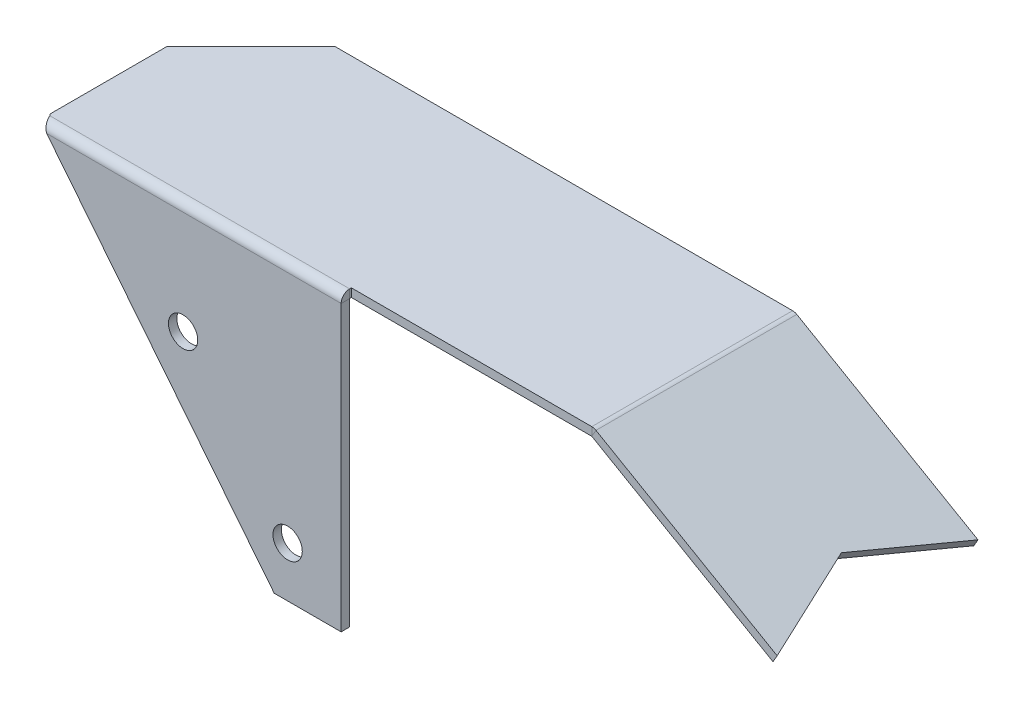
ISO-10303-21;
HEADER;
FILE_DESCRIPTION(('STEP AP214'),'2;1');
FILE_NAME('part.step','',(''),(''),'','','');
FILE_SCHEMA(('AUTOMOTIVE_DESIGN { 1 0 10303 214 1 1 1 1 }'));
ENDSEC;
DATA;
#1=APPLICATION_CONTEXT('core data for automotive mechanical design processes');
#2=APPLICATION_PROTOCOL_DEFINITION('international standard','automotive_design',2000,#1);
#3=PRODUCT_CONTEXT('',#1,'mechanical');
#4=PRODUCT('Part','Part','',(#3));
#5=PRODUCT_RELATED_PRODUCT_CATEGORY('part','',(#4));
#6=PRODUCT_DEFINITION_FORMATION('','',#4);
#7=PRODUCT_DEFINITION_CONTEXT('part definition',#1,'design');
#8=PRODUCT_DEFINITION('design','',#6,#7);
#9=PRODUCT_DEFINITION_SHAPE('','',#8);
#10=(LENGTH_UNIT() NAMED_UNIT(*) SI_UNIT(.MILLI.,.METRE.));
#11=(NAMED_UNIT(*) PLANE_ANGLE_UNIT() SI_UNIT($,.RADIAN.));
#12=(NAMED_UNIT(*) SI_UNIT($,.STERADIAN.) SOLID_ANGLE_UNIT());
#13=UNCERTAINTY_MEASURE_WITH_UNIT(LENGTH_MEASURE(1.E-05),#10,'distance_accuracy_value','');
#14=(GEOMETRIC_REPRESENTATION_CONTEXT(3) GLOBAL_UNCERTAINTY_ASSIGNED_CONTEXT((#13)) GLOBAL_UNIT_ASSIGNED_CONTEXT((#10,
#11,#12)) REPRESENTATION_CONTEXT('',''));
#15=CARTESIAN_POINT('',(0.,0.,0.));
#16=DIRECTION('',(0.,0.,1.));
#17=DIRECTION('',(1.,0.,0.));
#18=AXIS2_PLACEMENT_3D('',#15,#16,#17);
#19=CARTESIAN_POINT('',(0.,35.0000000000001,33.7811061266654));
#20=DIRECTION('',(0.,-1.,0.));
#21=DIRECTION('',(-1.,0.,0.));
#22=AXIS2_PLACEMENT_3D('',#19,#20,#21);
#23=PLANE('',#22);
#24=DIRECTION('',(1.,0.,0.));
#25=VECTOR('',#24,1.);
#26=CARTESIAN_POINT('',(8.,35.,-1.2188938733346));
#27=LINE('',#26,#25);
#28=CARTESIAN_POINT('',(8.,35.,-1.2188938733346));
#29=VERTEX_POINT('',#28);
#30=CARTESIAN_POINT('',(36.7317828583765,35.,-1.21889387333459));
#31=VERTEX_POINT('',#30);
#32=EDGE_CURVE('E67',#29,#31,#27,.T.);
#33=ORIENTED_EDGE('',*,*,#32,.T.);
#34=DIRECTION('',(0.,0.,-1.));
#35=VECTOR('',#34,1.);
#36=CARTESIAN_POINT('',(36.7317828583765,35.0000000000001,33.7811061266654));
#37=LINE('',#36,#35);
#38=CARTESIAN_POINT('',(36.7317828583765,34.9999999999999,-25.2188938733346));
#39=VERTEX_POINT('',#38);
#40=EDGE_CURVE('E59',#31,#39,#37,.T.);
#41=ORIENTED_EDGE('',*,*,#40,.T.);
#42=DIRECTION('',(-1.,0.,0.));
#43=VECTOR('',#42,1.);
#44=CARTESIAN_POINT('',(62.,35.,-25.2188938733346));
#45=LINE('',#44,#43);
#46=CARTESIAN_POINT('',(-18.,34.9999999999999,-25.2188938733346));
#47=VERTEX_POINT('',#46);
#48=EDGE_CURVE('E75',#39,#47,#45,.T.);
#49=ORIENTED_EDGE('',*,*,#48,.T.);
#50=DIRECTION('',(-0.707106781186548,0.,0.707106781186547));
#51=VECTOR('',#50,1.);
#52=CARTESIAN_POINT('',(-18.,34.9999999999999,-25.2188938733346));
#53=LINE('',#52,#51);
#54=CARTESIAN_POINT('',(-28.,35.,-15.2188938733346));
#55=VERTEX_POINT('',#54);
#56=EDGE_CURVE('E418',#47,#55,#53,.T.);
#57=ORIENTED_EDGE('',*,*,#56,.T.);
#58=DIRECTION('',(0.,0.,1.));
#59=VECTOR('',#58,1.);
#60=CARTESIAN_POINT('',(-28.,35.,-15.2188938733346));
#61=LINE('',#60,#59);
#62=CARTESIAN_POINT('',(-28.,35.,-1.2188938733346));
#63=VERTEX_POINT('',#62);
#64=EDGE_CURVE('E440',#55,#63,#61,.T.);
#65=ORIENTED_EDGE('',*,*,#64,.T.);
#66=DIRECTION('',(0.624695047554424,0.,0.78086880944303));
#67=VECTOR('',#66,1.);
#68=CARTESIAN_POINT('',(-28.,35.,-1.2188938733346));
#69=LINE('',#68,#67);
#70=CARTESIAN_POINT('',(-27.8328849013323,35.,-1.01));
#71=VERTEX_POINT('',#70);
#72=EDGE_CURVE('E316',#63,#71,#69,.T.);
#73=ORIENTED_EDGE('',*,*,#72,.T.);
#74=DIRECTION('',(-1.,0.,0.));
#75=VECTOR('',#74,1.);
#76=CARTESIAN_POINT('',(0.,35.,-1.01));
#77=LINE('',#76,#75);
#78=CARTESIAN_POINT('',(8.,35.,-1.01));
#79=VERTEX_POINT('',#78);
#80=EDGE_CURVE('E443',#79,#71,#77,.T.);
#81=ORIENTED_EDGE('',*,*,#80,.F.);
#82=DIRECTION('',(0.,0.,-1.));
#83=VECTOR('',#82,1.);
#84=CARTESIAN_POINT('',(7.99999999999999,35.0000000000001,33.7811061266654));
#85=LINE('',#84,#83);
#86=EDGE_CURVE('E419',#79,#29,#85,.T.);
#87=ORIENTED_EDGE('',*,*,#86,.T.);
#88=EDGE_LOOP('',(#33,#41,#49,#57,#65,#73,#81,#87));
#89=FACE_BOUND('',#88,.T.);
#90=ADVANCED_FACE('F50',(#89),#23,.F.);
#91=CARTESIAN_POINT('',(-28.,34.,-1.2188938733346));
#92=DIRECTION('',(-0.780868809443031,0.,0.624695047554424));
#93=DIRECTION('',(0.624695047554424,0.,0.780868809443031));
#94=AXIS2_PLACEMENT_3D('',#91,#92,#93);
#95=PLANE('',#94);
#96=DIRECTION('',(0.624695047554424,0.,0.78086880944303));
#97=VECTOR('',#96,1.);
#98=CARTESIAN_POINT('',(-28.,34.,-1.2188938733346));
#99=LINE('',#98,#97);
#100=CARTESIAN_POINT('',(-28.,34.,-1.2188938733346));
#101=VERTEX_POINT('',#100);
#102=CARTESIAN_POINT('',(-27.8328849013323,34.,-1.01));
#103=VERTEX_POINT('',#102);
#104=EDGE_CURVE('E431',#101,#103,#99,.T.);
#105=ORIENTED_EDGE('',*,*,#104,.T.);
#106=CARTESIAN_POINT('',(-27.8328849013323,35.,-1.01));
#107=CARTESIAN_POINT('',(-27.8328849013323,34.,-1.01));
#108=B_SPLINE_CURVE_WITH_KNOTS('',1,(#106,#107),.UNSPECIFIED.,.F.,.F.,(2,2),(0.,1.),.UNSPECIFIED.);
#109=EDGE_CURVE('E411',#103,#71,#108,.F.);
#110=ORIENTED_EDGE('',*,*,#109,.T.);
#111=ORIENTED_EDGE('',*,*,#72,.F.);
#112=DIRECTION('',(0.,1.,0.));
#113=VECTOR('',#112,1.);
#114=CARTESIAN_POINT('',(-28.,34.,-1.2188938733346));
#115=LINE('',#114,#113);
#116=EDGE_CURVE('E435',#101,#63,#115,.T.);
#117=ORIENTED_EDGE('',*,*,#116,.F.);
#118=EDGE_LOOP('',(#105,#110,#111,#117));
#119=FACE_BOUND('',#118,.T.);
#120=ADVANCED_FACE('F388',(#119),#95,.T.);
#121=CARTESIAN_POINT('',(7.99999999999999,34.0000000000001,33.7811061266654));
#122=DIRECTION('',(1.,0.,0.));
#123=DIRECTION('',(0.,-1.,0.));
#124=AXIS2_PLACEMENT_3D('',#121,#122,#123);
#125=PLANE('',#124);
#126=ORIENTED_EDGE('',*,*,#86,.F.);
#127=DIRECTION('',(0.,-1.,0.));
#128=VECTOR('',#127,1.);
#129=CARTESIAN_POINT('',(8.,34.0000000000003,-1.01));
#130=LINE('',#129,#128);
#131=CARTESIAN_POINT('',(8.,34.,-1.01));
#132=VERTEX_POINT('',#131);
#133=EDGE_CURVE('E428',#79,#132,#130,.T.);
#134=ORIENTED_EDGE('',*,*,#133,.T.);
#135=DIRECTION('',(0.,0.,-1.));
#136=VECTOR('',#135,1.);
#137=CARTESIAN_POINT('',(7.99999999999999,34.0000000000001,33.7811061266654));
#138=LINE('',#137,#136);
#139=CARTESIAN_POINT('',(8.,34.,-1.2188938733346));
#140=VERTEX_POINT('',#139);
#141=EDGE_CURVE('E417',#132,#140,#138,.T.);
#142=ORIENTED_EDGE('',*,*,#141,.T.);
#143=DIRECTION('',(0.,1.,0.));
#144=VECTOR('',#143,1.);
#145=CARTESIAN_POINT('',(8.,34.,-1.2188938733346));
#146=LINE('',#145,#144);
#147=EDGE_CURVE('E478',#140,#29,#146,.T.);
#148=ORIENTED_EDGE('',*,*,#147,.T.);
#149=EDGE_LOOP('',(#126,#134,#142,#148));
#150=FACE_BOUND('',#149,.T.);
#151=ADVANCED_FACE('F385',(#150),#125,.T.);
#152=CARTESIAN_POINT('',(0.,34.0000000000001,33.7811061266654));
#153=DIRECTION('',(0.,-1.,0.));
#154=DIRECTION('',(-1.,0.,0.));
#155=AXIS2_PLACEMENT_3D('',#152,#153,#154);
#156=PLANE('',#155);
#157=DIRECTION('',(0.,0.,-1.));
#158=VECTOR('',#157,1.);
#159=CARTESIAN_POINT('',(36.7317828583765,34.0000000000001,33.7811061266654));
#160=LINE('',#159,#158);
#161=CARTESIAN_POINT('',(36.7317828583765,34.,-1.21889387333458));
#162=VERTEX_POINT('',#161);
#163=CARTESIAN_POINT('',(36.7317828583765,33.9999999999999,-25.2188938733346));
#164=VERTEX_POINT('',#163);
#165=EDGE_CURVE('E402',#162,#164,#160,.T.);
#166=ORIENTED_EDGE('',*,*,#165,.F.);
#167=DIRECTION('',(1.,0.,0.));
#168=VECTOR('',#167,1.);
#169=CARTESIAN_POINT('',(8.,34.,-1.2188938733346));
#170=LINE('',#169,#168);
#171=EDGE_CURVE('E415',#140,#162,#170,.T.);
#172=ORIENTED_EDGE('',*,*,#171,.F.);
#173=ORIENTED_EDGE('',*,*,#141,.F.);
#174=DIRECTION('',(-1.,0.,0.));
#175=VECTOR('',#174,1.);
#176=CARTESIAN_POINT('',(0.,34.,-1.01));
#177=LINE('',#176,#175);
#178=EDGE_CURVE('E432',#132,#103,#177,.T.);
#179=ORIENTED_EDGE('',*,*,#178,.T.);
#180=ORIENTED_EDGE('',*,*,#104,.F.);
#181=DIRECTION('',(0.,0.,1.));
#182=VECTOR('',#181,1.);
#183=CARTESIAN_POINT('',(-28.,34.,-15.2188938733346));
#184=LINE('',#183,#182);
#185=CARTESIAN_POINT('',(-28.,34.,-15.2188938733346));
#186=VERTEX_POINT('',#185);
#187=EDGE_CURVE('E479',#186,#101,#184,.T.);
#188=ORIENTED_EDGE('',*,*,#187,.F.);
#189=DIRECTION('',(-0.707106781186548,0.,0.707106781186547));
#190=VECTOR('',#189,1.);
#191=CARTESIAN_POINT('',(-18.,33.9999999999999,-25.2188938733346));
#192=LINE('',#191,#190);
#193=CARTESIAN_POINT('',(-18.,33.9999999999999,-25.2188938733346));
#194=VERTEX_POINT('',#193);
#195=EDGE_CURVE('E480',#194,#186,#192,.T.);
#196=ORIENTED_EDGE('',*,*,#195,.F.);
#197=DIRECTION('',(-1.,0.,0.));
#198=VECTOR('',#197,1.);
#199=CARTESIAN_POINT('',(62.,34.,-25.2188938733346));
#200=LINE('',#199,#198);
#201=EDGE_CURVE('E54',#164,#194,#200,.T.);
#202=ORIENTED_EDGE('',*,*,#201,.F.);
#203=EDGE_LOOP('',(#166,#172,#173,#179,#180,#188,#196,#202));
#204=FACE_BOUND('',#203,.T.);
#205=ADVANCED_FACE('F379',(#204),#156,.T.);
#206=CARTESIAN_POINT('',(-28.,34.,-15.2188938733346));
#207=DIRECTION('',(-1.,0.,0.));
#208=DIRECTION('',(0.,0.,1.));
#209=AXIS2_PLACEMENT_3D('',#206,#207,#208);
#210=PLANE('',#209);
#211=ORIENTED_EDGE('',*,*,#64,.F.);
#212=DIRECTION('',(0.,1.,0.));
#213=VECTOR('',#212,1.);
#214=CARTESIAN_POINT('',(-28.,34.,-15.2188938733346));
#215=LINE('',#214,#213);
#216=EDGE_CURVE('E471',#186,#55,#215,.T.);
#217=ORIENTED_EDGE('',*,*,#216,.F.);
#218=ORIENTED_EDGE('',*,*,#187,.T.);
#219=ORIENTED_EDGE('',*,*,#116,.T.);
#220=EDGE_LOOP('',(#211,#217,#218,#219));
#221=FACE_BOUND('',#220,.T.);
#222=ADVANCED_FACE('F375',(#221),#210,.T.);
#223=CARTESIAN_POINT('',(-18.,33.9999999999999,-25.2188938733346));
#224=DIRECTION('',(-0.707106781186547,0.,-0.707106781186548));
#225=DIRECTION('',(-0.707106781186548,0.,0.707106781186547));
#226=AXIS2_PLACEMENT_3D('',#223,#224,#225);
#227=PLANE('',#226);
#228=ORIENTED_EDGE('',*,*,#56,.F.);
#229=DIRECTION('',(0.,1.,0.));
#230=VECTOR('',#229,1.);
#231=CARTESIAN_POINT('',(-18.,33.9999999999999,-25.2188938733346));
#232=LINE('',#231,#230);
#233=EDGE_CURVE('E473',#194,#47,#232,.T.);
#234=ORIENTED_EDGE('',*,*,#233,.F.);
#235=ORIENTED_EDGE('',*,*,#195,.T.);
#236=ORIENTED_EDGE('',*,*,#216,.T.);
#237=EDGE_LOOP('',(#228,#234,#235,#236));
#238=FACE_BOUND('',#237,.T.);
#239=ADVANCED_FACE('F378',(#238),#227,.T.);
#240=CARTESIAN_POINT('',(62.,34.,-25.2188938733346));
#241=DIRECTION('',(0.,0.,-1.));
#242=DIRECTION('',(-1.,0.,0.));
#243=AXIS2_PLACEMENT_3D('',#240,#241,#242);
#244=PLANE('',#243);
#245=DIRECTION('',(0.,1.,0.));
#246=VECTOR('',#245,1.);
#247=CARTESIAN_POINT('',(36.7317828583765,33.9999999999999,-25.2188938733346));
#248=LINE('',#247,#246);
#249=EDGE_CURVE('E410',#164,#39,#248,.T.);
#250=ORIENTED_EDGE('',*,*,#249,.F.);
#251=ORIENTED_EDGE('',*,*,#201,.T.);
#252=ORIENTED_EDGE('',*,*,#233,.T.);
#253=ORIENTED_EDGE('',*,*,#48,.F.);
#254=EDGE_LOOP('',(#250,#251,#252,#253));
#255=FACE_BOUND('',#254,.T.);
#256=ADVANCED_FACE('F383',(#255),#244,.T.);
#257=CARTESIAN_POINT('',(8.,34.,-1.2188938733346));
#258=DIRECTION('',(0.,0.,1.));
#259=DIRECTION('',(0.,-1.,0.));
#260=AXIS2_PLACEMENT_3D('',#257,#258,#259);
#261=PLANE('',#260);
#262=DIRECTION('',(0.,-1.,0.));
#263=VECTOR('',#262,1.);
#264=CARTESIAN_POINT('',(36.7317828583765,34.,-1.21889387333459));
#265=LINE('',#264,#263);
#266=EDGE_CURVE('E12',#31,#162,#265,.T.);
#267=ORIENTED_EDGE('',*,*,#266,.F.);
#268=ORIENTED_EDGE('',*,*,#32,.F.);
#269=ORIENTED_EDGE('',*,*,#147,.F.);
#270=ORIENTED_EDGE('',*,*,#171,.T.);
#271=EDGE_LOOP('',(#267,#268,#269,#270));
#272=FACE_BOUND('',#271,.T.);
#273=ADVANCED_FACE('F52',(#272),#261,.T.);
#274=CARTESIAN_POINT('',(-10.8907767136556,21.6173761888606,-1.));
#275=DIRECTION('',(0.,0.,1.));
#276=DIRECTION('',(1.,0.,0.));
#277=AXIS2_PLACEMENT_3D('',#274,#275,#276);
#278=CYLINDRICAL_SURFACE('',#277,1.75);
#279=CARTESIAN_POINT('',(-10.8907767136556,21.6173761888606,-1.));
#280=DIRECTION('',(0.,0.,1.));
#281=DIRECTION('',(1.,0.,0.));
#282=AXIS2_PLACEMENT_3D('',#279,#280,#281);
#283=CIRCLE('',#282,1.75);
#284=CARTESIAN_POINT('',(-9.14077671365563,21.6173761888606,-1.));
#285=VERTEX_POINT('',#284);
#286=EDGE_CURVE('E327',#285,#285,#283,.T.);
#287=ORIENTED_EDGE('',*,*,#286,.F.);
#288=EDGE_LOOP('',(#287));
#289=FACE_BOUND('',#288,.T.);
#290=CARTESIAN_POINT('',(-10.8907767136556,21.6173761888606,0.));
#291=DIRECTION('',(0.,0.,1.));
#292=DIRECTION('',(1.,0.,0.));
#293=AXIS2_PLACEMENT_3D('',#290,#291,#292);
#294=CIRCLE('',#293,1.75);
#295=CARTESIAN_POINT('',(-9.14077671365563,21.6173761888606,0.));
#296=VERTEX_POINT('',#295);
#297=EDGE_CURVE('E341',#296,#296,#294,.T.);
#298=ORIENTED_EDGE('',*,*,#297,.T.);
#299=EDGE_LOOP('',(#298));
#300=FACE_BOUND('',#299,.T.);
#301=ADVANCED_FACE('F280',(#289,#300),#278,.F.);
#302=CARTESIAN_POINT('',(1.60312423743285,6.,-1.));
#303=DIRECTION('',(0.,0.,1.));
#304=DIRECTION('',(1.,0.,0.));
#305=AXIS2_PLACEMENT_3D('',#302,#303,#304);
#306=CYLINDRICAL_SURFACE('',#305,1.75);
#307=CARTESIAN_POINT('',(1.60312423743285,6.,-1.));
#308=DIRECTION('',(0.,0.,1.));
#309=DIRECTION('',(1.,0.,0.));
#310=AXIS2_PLACEMENT_3D('',#307,#308,#309);
#311=CIRCLE('',#310,1.75);
#312=CARTESIAN_POINT('',(3.35312423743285,6.,-1.));
#313=VERTEX_POINT('',#312);
#314=EDGE_CURVE('E330',#313,#313,#311,.T.);
#315=ORIENTED_EDGE('',*,*,#314,.F.);
#316=EDGE_LOOP('',(#315));
#317=FACE_BOUND('',#316,.T.);
#318=CARTESIAN_POINT('',(1.60312423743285,6.,0.));
#319=DIRECTION('',(0.,0.,1.));
#320=DIRECTION('',(1.,0.,0.));
#321=AXIS2_PLACEMENT_3D('',#318,#319,#320);
#322=CIRCLE('',#321,1.75);
#323=CARTESIAN_POINT('',(3.35312423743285,6.,0.));
#324=VERTEX_POINT('',#323);
#325=EDGE_CURVE('E338',#324,#324,#322,.T.);
#326=ORIENTED_EDGE('',*,*,#325,.T.);
#327=EDGE_LOOP('',(#326));
#328=FACE_BOUND('',#327,.T.);
#329=ADVANCED_FACE('F551',(#317,#328),#306,.F.);
#330=CARTESIAN_POINT('',(0.,0.,-1.));
#331=DIRECTION('',(0.,-1.,0.));
#332=DIRECTION('',(0.,0.,-1.));
#333=AXIS2_PLACEMENT_3D('',#330,#331,#332);
#334=PLANE('',#333);
#335=DIRECTION('',(1.,0.,0.));
#336=VECTOR('',#335,1.);
#337=CARTESIAN_POINT('',(0.,0.,0.));
#338=LINE('',#337,#336);
#339=CARTESIAN_POINT('',(0.,0.,0.));
#340=VERTEX_POINT('',#339);
#341=CARTESIAN_POINT('',(8.,0.,0.));
#342=VERTEX_POINT('',#341);
#343=EDGE_CURVE('E318',#340,#342,#338,.T.);
#344=ORIENTED_EDGE('',*,*,#343,.F.);
#345=DIRECTION('',(0.,0.,1.));
#346=VECTOR('',#345,1.);
#347=CARTESIAN_POINT('',(0.,0.,-1.));
#348=LINE('',#347,#346);
#349=CARTESIAN_POINT('',(0.,0.,-1.));
#350=VERTEX_POINT('',#349);
#351=EDGE_CURVE('E308',#350,#340,#348,.T.);
#352=ORIENTED_EDGE('',*,*,#351,.F.);
#353=DIRECTION('',(1.,0.,0.));
#354=VECTOR('',#353,1.);
#355=CARTESIAN_POINT('',(0.,0.,-1.));
#356=LINE('',#355,#354);
#357=CARTESIAN_POINT('',(8.,0.,-1.));
#358=VERTEX_POINT('',#357);
#359=EDGE_CURVE('E335',#350,#358,#356,.T.);
#360=ORIENTED_EDGE('',*,*,#359,.T.);
#361=DIRECTION('',(0.,0.,1.));
#362=VECTOR('',#361,1.);
#363=CARTESIAN_POINT('',(8.,0.,-1.));
#364=LINE('',#363,#362);
#365=EDGE_CURVE('E333',#358,#342,#364,.T.);
#366=ORIENTED_EDGE('',*,*,#365,.T.);
#367=EDGE_LOOP('',(#344,#352,#360,#366));
#368=FACE_BOUND('',#367,.T.);
#369=ADVANCED_FACE('F556',(#368),#334,.T.);
#370=CARTESIAN_POINT('',(0.,0.,-1.));
#371=DIRECTION('',(0.,0.,-1.));
#372=DIRECTION('',(-1.,0.,0.));
#373=AXIS2_PLACEMENT_3D('',#370,#371,#372);
#374=PLANE('',#373);
#375=DIRECTION('',(-1.,0.,0.));
#376=VECTOR('',#375,1.);
#377=CARTESIAN_POINT('',(0.,33.99,-1.));
#378=LINE('',#377,#376);
#379=CARTESIAN_POINT('',(8.,33.99,-0.999999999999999));
#380=VERTEX_POINT('',#379);
#381=CARTESIAN_POINT('',(-27.192,33.99,-1.));
#382=VERTEX_POINT('',#381);
#383=EDGE_CURVE('E361',#380,#382,#378,.T.);
#384=ORIENTED_EDGE('',*,*,#383,.F.);
#385=DIRECTION('',(0.,1.,0.));
#386=VECTOR('',#385,1.);
#387=CARTESIAN_POINT('',(8.,0.,-1.));
#388=LINE('',#387,#386);
#389=EDGE_CURVE('E325',#358,#380,#388,.T.);
#390=ORIENTED_EDGE('',*,*,#389,.F.);
#391=ORIENTED_EDGE('',*,*,#359,.F.);
#392=DIRECTION('',(0.624695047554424,-0.78086880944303,0.));
#393=VECTOR('',#392,1.);
#394=CARTESIAN_POINT('',(-28.,35.,-1.));
#395=LINE('',#394,#393);
#396=EDGE_CURVE('E317',#382,#350,#395,.T.);
#397=ORIENTED_EDGE('',*,*,#396,.F.);
#398=EDGE_LOOP('',(#384,#390,#391,#397));
#399=FACE_BOUND('',#398,.T.);
#400=ORIENTED_EDGE('',*,*,#314,.T.);
#401=EDGE_LOOP('',(#400));
#402=FACE_BOUND('',#401,.T.);
#403=ORIENTED_EDGE('',*,*,#286,.T.);
#404=EDGE_LOOP('',(#403));
#405=FACE_BOUND('',#404,.T.);
#406=ADVANCED_FACE('F567',(#399,#402,#405),#374,.T.);
#407=CARTESIAN_POINT('',(8.,0.,-1.));
#408=DIRECTION('',(1.,0.,0.));
#409=DIRECTION('',(0.,0.,-1.));
#410=AXIS2_PLACEMENT_3D('',#407,#408,#409);
#411=PLANE('',#410);
#412=DIRECTION('',(0.,0.,-1.));
#413=VECTOR('',#412,1.);
#414=CARTESIAN_POINT('',(8.,33.99,-0.999999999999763));
#415=LINE('',#414,#413);
#416=CARTESIAN_POINT('',(8.,33.99,0.));
#417=VERTEX_POINT('',#416);
#418=EDGE_CURVE('E344',#417,#380,#415,.T.);
#419=ORIENTED_EDGE('',*,*,#418,.F.);
#420=DIRECTION('',(0.,1.,0.));
#421=VECTOR('',#420,1.);
#422=CARTESIAN_POINT('',(8.,0.,0.));
#423=LINE('',#422,#421);
#424=EDGE_CURVE('E322',#342,#417,#423,.T.);
#425=ORIENTED_EDGE('',*,*,#424,.F.);
#426=ORIENTED_EDGE('',*,*,#365,.F.);
#427=ORIENTED_EDGE('',*,*,#389,.T.);
#428=EDGE_LOOP('',(#419,#425,#426,#427));
#429=FACE_BOUND('',#428,.T.);
#430=ADVANCED_FACE('F459',(#429),#411,.T.);
#431=CARTESIAN_POINT('',(0.,0.,0.));
#432=DIRECTION('',(0.,0.,-1.));
#433=DIRECTION('',(-1.,0.,0.));
#434=AXIS2_PLACEMENT_3D('',#431,#432,#433);
#435=PLANE('',#434);
#436=ORIENTED_EDGE('',*,*,#325,.F.);
#437=EDGE_LOOP('',(#436));
#438=FACE_BOUND('',#437,.T.);
#439=ORIENTED_EDGE('',*,*,#297,.F.);
#440=EDGE_LOOP('',(#439));
#441=FACE_BOUND('',#440,.T.);
#442=ORIENTED_EDGE('',*,*,#424,.T.);
#443=DIRECTION('',(-1.,0.,0.));
#444=VECTOR('',#443,1.);
#445=CARTESIAN_POINT('',(0.,33.99,0.));
#446=LINE('',#445,#444);
#447=CARTESIAN_POINT('',(-27.192,33.99,0.));
#448=VERTEX_POINT('',#447);
#449=EDGE_CURVE('E324',#417,#448,#446,.T.);
#450=ORIENTED_EDGE('',*,*,#449,.T.);
#451=DIRECTION('',(0.624695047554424,-0.78086880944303,0.));
#452=VECTOR('',#451,1.);
#453=CARTESIAN_POINT('',(-28.,35.,0.));
#454=LINE('',#453,#452);
#455=EDGE_CURVE('E321',#448,#340,#454,.T.);
#456=ORIENTED_EDGE('',*,*,#455,.T.);
#457=ORIENTED_EDGE('',*,*,#343,.T.);
#458=EDGE_LOOP('',(#442,#450,#456,#457));
#459=FACE_BOUND('',#458,.T.);
#460=ADVANCED_FACE('F373',(#438,#441,#459),#435,.F.);
#461=CARTESIAN_POINT('',(-28.,35.,-1.));
#462=DIRECTION('',(-0.78086880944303,-0.624695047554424,0.));
#463=DIRECTION('',(0.624695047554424,-0.78086880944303,0.));
#464=AXIS2_PLACEMENT_3D('',#461,#462,#463);
#465=PLANE('',#464);
#466=CARTESIAN_POINT('',(-27.192,33.99,-1.));
#467=CARTESIAN_POINT('',(-27.192,33.9899999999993,0.));
#468=B_SPLINE_CURVE_WITH_KNOTS('',1,(#466,#467),.UNSPECIFIED.,.F.,.F.,(2,2),(0.,1.),.UNSPECIFIED.);
#469=EDGE_CURVE('E304',#382,#448,#468,.T.);
#470=ORIENTED_EDGE('',*,*,#469,.F.);
#471=ORIENTED_EDGE('',*,*,#396,.T.);
#472=ORIENTED_EDGE('',*,*,#351,.T.);
#473=ORIENTED_EDGE('',*,*,#455,.F.);
#474=EDGE_LOOP('',(#470,#471,#472,#473));
#475=FACE_BOUND('',#474,.T.);
#476=ADVANCED_FACE('F363',(#475),#465,.T.);
#477=CARTESIAN_POINT('',(8.,33.99,-1.01));
#478=DIRECTION('',(-1.,0.,-1.73472347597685E-13));
#479=DIRECTION('',(-1.73472347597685E-13,0.,1.));
#480=AXIS2_PLACEMENT_3D('',#477,#478,#479);
#481=PLANE('',#480);
#482=ORIENTED_EDGE('',*,*,#133,.F.);
#483=CARTESIAN_POINT('',(8.,33.99,-1.01));
#484=DIRECTION('',(1.,0.,0.));
#485=DIRECTION('',(0.,1.,0.));
#486=AXIS2_PLACEMENT_3D('',#483,#484,#485);
#487=CIRCLE('',#486,1.01);
#488=EDGE_CURVE('E211',#79,#417,#487,.T.);
#489=ORIENTED_EDGE('',*,*,#488,.T.);
#490=ORIENTED_EDGE('',*,*,#418,.T.);
#491=CARTESIAN_POINT('',(8.,33.99,-1.01));
#492=DIRECTION('',(1.,0.,1.73472347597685E-13));
#493=DIRECTION('',(-1.73472347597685E-13,0.,1.));
#494=AXIS2_PLACEMENT_3D('',#491,#492,#493);
#495=CIRCLE('',#494,0.0100000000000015);
#496=EDGE_CURVE('E216',#132,#380,#495,.T.);
#497=ORIENTED_EDGE('',*,*,#496,.F.);
#498=EDGE_LOOP('',(#482,#489,#490,#497));
#499=FACE_BOUND('',#498,.T.);
#500=ADVANCED_FACE('F248',(#499),#481,.F.);
#501=CARTESIAN_POINT('',(-27.192,33.9899999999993,0.));
#502=CARTESIAN_POINT('',(-27.2454153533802,34.1222291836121,0.));
#503=CARTESIAN_POINT('',(-27.2988141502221,34.254365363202,-0.0262875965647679));
#504=CARTESIAN_POINT('',(-27.4056283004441,34.498655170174,-0.127475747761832));
#505=CARTESIAN_POINT('',(-27.4590353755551,34.6106921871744,-0.202336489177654));
#506=CARTESIAN_POINT('',(-27.5658495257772,34.797663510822,-0.389307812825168));
#507=CARTESIAN_POINT('',(-27.6192566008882,34.8725242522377,-0.501344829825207));
#508=CARTESIAN_POINT('',(-27.7260707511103,34.973712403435,-0.745634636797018));
#509=CARTESIAN_POINT('',(-27.7794695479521,35.,-0.877770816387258));
#510=CARTESIAN_POINT('',(-27.8328849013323,35.,-1.01));
#511=CARTESIAN_POINT('',(-27.192,33.99,-1.));
#512=CARTESIAN_POINT('',(-27.2454070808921,33.9913089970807,-0.999999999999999));
#513=CARTESIAN_POINT('',(-27.2988141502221,33.9926174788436,-1.00026027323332));
#514=CARTESIAN_POINT('',(-27.4056283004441,33.9950361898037,-1.00126213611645));
#515=CARTESIAN_POINT('',(-27.4590353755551,33.9961454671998,-1.00200333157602));
#516=CARTESIAN_POINT('',(-27.5658495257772,33.997996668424,-1.00385453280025));
#517=CARTESIAN_POINT('',(-27.6192566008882,33.9987378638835,-1.00496381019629));
#518=CARTESIAN_POINT('',(-27.7260707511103,33.9997397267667,-1.00738252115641));
#519=CARTESIAN_POINT('',(-27.7794778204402,34.,-1.00869100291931));
#520=CARTESIAN_POINT('',(-27.8328849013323,34.,-1.01));
#521=B_SPLINE_SURFACE_WITH_KNOTS('',1,3,((#501,#502,#503,#504,#505,#506,#507,#508,#509,#510),
(#511,#512,#513,#514,#515,#516,#517,#518,#519,#520)),.UNSPECIFIED.,.F.,.F.,.F.,(2,2),(4,2,2,2,
4),(0.,1.),(0.,0.25,0.5,0.75,1.),.UNSPECIFIED.);
#522=CARTESIAN_POINT('',(-27.192,33.9899999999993,0.));
#523=CARTESIAN_POINT('',(-27.2454153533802,34.1222291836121,0.));
#524=CARTESIAN_POINT('',(-27.2988141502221,34.254365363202,-0.0262875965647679));
#525=CARTESIAN_POINT('',(-27.4056283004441,34.498655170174,-0.127475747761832));
#526=CARTESIAN_POINT('',(-27.4590353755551,34.6106921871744,-0.202336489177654));
#527=CARTESIAN_POINT('',(-27.5658495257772,34.797663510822,-0.389307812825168));
#528=CARTESIAN_POINT('',(-27.6192566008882,34.8725242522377,-0.501344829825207));
#529=CARTESIAN_POINT('',(-27.7260707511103,34.973712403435,-0.745634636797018));
#530=CARTESIAN_POINT('',(-27.7794695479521,35.,-0.877770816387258));
#531=CARTESIAN_POINT('',(-27.8328849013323,35.,-1.01));
#532=B_SPLINE_CURVE_WITH_KNOTS('',3,(#522,#523,#524,#525,#526,#527,#528,#529,#530,#531),
.UNSPECIFIED.,.F.,.F.,(4,2,2,2,4),(0.,0.25,0.5,0.75,1.),.UNSPECIFIED.);
#533=EDGE_CURVE('E220',#448,#71,#532,.T.);
#534=CARTESIAN_POINT('',(-27.8328849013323,34.,-1.01));
#535=CARTESIAN_POINT('',(-27.7794778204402,34.,-1.00869100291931));
#536=CARTESIAN_POINT('',(-27.7260707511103,33.9997397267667,-1.00738252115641));
#537=CARTESIAN_POINT('',(-27.6192566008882,33.9987378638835,-1.00496381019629));
#538=CARTESIAN_POINT('',(-27.5658495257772,33.997996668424,-1.00385453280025));
#539=CARTESIAN_POINT('',(-27.4590353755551,33.9961454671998,-1.00200333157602));
#540=CARTESIAN_POINT('',(-27.4056283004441,33.9950361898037,-1.00126213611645));
#541=CARTESIAN_POINT('',(-27.2988141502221,33.9926174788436,-1.00026027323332));
#542=CARTESIAN_POINT('',(-27.2454070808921,33.9913089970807,-0.999999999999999));
#543=CARTESIAN_POINT('',(-27.192,33.99,-1.));
#544=B_SPLINE_CURVE_WITH_KNOTS('',3,(#534,#535,#536,#537,#538,#539,#540,#541,#542,#543),
.UNSPECIFIED.,.F.,.F.,(4,2,2,2,4),(0.,0.25,0.5,0.75,1.),.UNSPECIFIED.);
#545=EDGE_CURVE('E219',#382,#103,#544,.F.);
#546=ORIENTED_EDGE('',*,*,#533,.T.);
#547=ORIENTED_EDGE('',*,*,#109,.F.);
#548=ORIENTED_EDGE('',*,*,#545,.F.);
#549=ORIENTED_EDGE('',*,*,#469,.T.);
#550=EDGE_LOOP('',(#546,#547,#548,#549));
#551=FACE_BOUND('',#550,.T.);
#552=ADVANCED_FACE('F239',(#551),#521,.F.);
#553=CARTESIAN_POINT('',(-45.4517863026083,33.99,-1.01));
#554=DIRECTION('',(1.,0.,0.));
#555=DIRECTION('',(0.,1.,0.));
#556=AXIS2_PLACEMENT_3D('',#553,#554,#555);
#557=CYLINDRICAL_SURFACE('',#556,0.01);
#558=ORIENTED_EDGE('',*,*,#383,.T.);
#559=ORIENTED_EDGE('',*,*,#545,.T.);
#560=ORIENTED_EDGE('',*,*,#178,.F.);
#561=ORIENTED_EDGE('',*,*,#496,.T.);
#562=EDGE_LOOP('',(#558,#559,#560,#561));
#563=FACE_BOUND('',#562,.T.);
#564=ADVANCED_FACE('F228',(#563),#557,.F.);
#565=CARTESIAN_POINT('',(-45.4517863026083,33.99,-1.01));
#566=DIRECTION('',(1.,0.,0.));
#567=DIRECTION('',(0.,1.,0.));
#568=AXIS2_PLACEMENT_3D('',#565,#566,#567);
#569=CYLINDRICAL_SURFACE('',#568,1.01);
#570=ORIENTED_EDGE('',*,*,#449,.F.);
#571=ORIENTED_EDGE('',*,*,#488,.F.);
#572=ORIENTED_EDGE('',*,*,#80,.T.);
#573=ORIENTED_EDGE('',*,*,#533,.F.);
#574=EDGE_LOOP('',(#570,#571,#572,#573));
#575=FACE_BOUND('',#574,.T.);
#576=ADVANCED_FACE('F238',(#575),#569,.T.);
#577=CARTESIAN_POINT('',(36.7317828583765,33.999,-1.21889387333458));
#578=DIRECTION('',(0.,0.,-1.));
#579=DIRECTION('',(-1.,0.,0.));
#580=AXIS2_PLACEMENT_3D('',#577,#578,#579);
#581=PLANE('',#580);
#582=DIRECTION('',(-0.500000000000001,-0.866025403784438,0.));
#583=VECTOR('',#582,1.);
#584=CARTESIAN_POINT('',(36.7322828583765,33.9998660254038,-1.21889387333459));
#585=LINE('',#584,#583);
#586=CARTESIAN_POINT('',(37.2322828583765,34.8658914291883,-1.21889387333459));
#587=VERTEX_POINT('',#586);
#588=CARTESIAN_POINT('',(36.7322828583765,33.9998660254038,-1.21889387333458));
#589=VERTEX_POINT('',#588);
#590=EDGE_CURVE('E178',#587,#589,#585,.T.);
#591=ORIENTED_EDGE('',*,*,#590,.F.);
#592=CARTESIAN_POINT('',(36.7317828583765,33.999,-1.21889387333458));
#593=DIRECTION('',(0.,0.,1.));
#594=DIRECTION('',(0.,-1.,0.));
#595=AXIS2_PLACEMENT_3D('',#592,#593,#594);
#596=CIRCLE('',#595,1.001);
#597=EDGE_CURVE('E189',#587,#31,#596,.T.);
#598=ORIENTED_EDGE('',*,*,#597,.T.);
#599=ORIENTED_EDGE('',*,*,#266,.T.);
#600=CARTESIAN_POINT('',(36.7317828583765,33.999,-1.21889387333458));
#601=DIRECTION('',(0.,0.,1.));
#602=DIRECTION('',(-1.,0.,0.));
#603=AXIS2_PLACEMENT_3D('',#600,#601,#602);
#604=CIRCLE('',#603,0.000999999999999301);
#605=EDGE_CURVE('E204',#589,#162,#604,.T.);
#606=ORIENTED_EDGE('',*,*,#605,.F.);
#607=EDGE_LOOP('',(#591,#598,#599,#606));
#608=FACE_BOUND('',#607,.T.);
#609=ADVANCED_FACE('F246',(#608),#581,.F.);
#610=CARTESIAN_POINT('',(36.7317828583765,33.9989999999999,-25.2188938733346));
#611=DIRECTION('',(0.,0.,1.));
#612=DIRECTION('',(1.,0.,0.));
#613=AXIS2_PLACEMENT_3D('',#610,#611,#612);
#614=PLANE('',#613);
#615=CARTESIAN_POINT('',(36.7317828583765,33.9989999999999,-25.2188938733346));
#616=DIRECTION('',(0.,0.,1.));
#617=DIRECTION('',(0.,-1.,0.));
#618=AXIS2_PLACEMENT_3D('',#615,#616,#617);
#619=CIRCLE('',#618,1.001);
#620=CARTESIAN_POINT('',(37.2322828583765,34.8658914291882,-25.2188938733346));
#621=VERTEX_POINT('',#620);
#622=EDGE_CURVE('E208',#39,#621,#619,.F.);
#623=ORIENTED_EDGE('',*,*,#622,.T.);
#624=DIRECTION('',(0.500000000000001,0.866025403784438,0.));
#625=VECTOR('',#624,1.);
#626=CARTESIAN_POINT('',(36.7322828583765,33.9998660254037,-25.2188938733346));
#627=LINE('',#626,#625);
#628=CARTESIAN_POINT('',(36.7322828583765,33.9998660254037,-25.2188938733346));
#629=VERTEX_POINT('',#628);
#630=EDGE_CURVE('E497',#629,#621,#627,.T.);
#631=ORIENTED_EDGE('',*,*,#630,.F.);
#632=CARTESIAN_POINT('',(36.7317828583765,33.9989999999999,-25.2188938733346));
#633=DIRECTION('',(0.,0.,-1.));
#634=DIRECTION('',(1.,0.,0.));
#635=AXIS2_PLACEMENT_3D('',#632,#633,#634);
#636=CIRCLE('',#635,0.000999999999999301);
#637=EDGE_CURVE('E207',#164,#629,#636,.T.);
#638=ORIENTED_EDGE('',*,*,#637,.F.);
#639=ORIENTED_EDGE('',*,*,#249,.T.);
#640=EDGE_LOOP('',(#623,#631,#638,#639));
#641=FACE_BOUND('',#640,.T.);
#642=ADVANCED_FACE('F241',(#641),#614,.F.);
#643=CARTESIAN_POINT('',(36.7317828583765,33.9989999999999,-37.2411504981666));
#644=DIRECTION('',(0.,0.,1.));
#645=DIRECTION('',(0.,-1.,0.));
#646=AXIS2_PLACEMENT_3D('',#643,#644,#645);
#647=CYLINDRICAL_SURFACE('',#646,0.001);
#648=ORIENTED_EDGE('',*,*,#165,.T.);
#649=ORIENTED_EDGE('',*,*,#637,.T.);
#650=DIRECTION('',(0.,0.,-1.));
#651=VECTOR('',#650,1.);
#652=CARTESIAN_POINT('',(36.7322828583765,33.9998660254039,33.7811061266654));
#653=LINE('',#652,#651);
#654=EDGE_CURVE('E505',#589,#629,#653,.T.);
#655=ORIENTED_EDGE('',*,*,#654,.F.);
#656=ORIENTED_EDGE('',*,*,#605,.T.);
#657=EDGE_LOOP('',(#648,#649,#655,#656));
#658=FACE_BOUND('',#657,.T.);
#659=ADVANCED_FACE('F493',(#658),#647,.F.);
#660=CARTESIAN_POINT('',(36.7317828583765,33.9989999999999,-37.2411504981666));
#661=DIRECTION('',(0.,0.,1.));
#662=DIRECTION('',(0.,-1.,0.));
#663=AXIS2_PLACEMENT_3D('',#660,#661,#662);
#664=CYLINDRICAL_SURFACE('',#663,1.001);
#665=ORIENTED_EDGE('',*,*,#40,.F.);
#666=ORIENTED_EDGE('',*,*,#597,.F.);
#667=DIRECTION('',(0.,0.,-1.));
#668=VECTOR('',#667,1.);
#669=CARTESIAN_POINT('',(37.2322828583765,34.8658914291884,33.7811061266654));
#670=LINE('',#669,#668);
#671=EDGE_CURVE('E197',#587,#621,#670,.T.);
#672=ORIENTED_EDGE('',*,*,#671,.T.);
#673=ORIENTED_EDGE('',*,*,#622,.F.);
#674=EDGE_LOOP('',(#665,#666,#672,#673));
#675=FACE_BOUND('',#674,.T.);
#676=ADVANCED_FACE('F529',(#675),#664,.T.);
#677=CARTESIAN_POINT('',(58.3880224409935,21.4969189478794,-1.21889387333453));
#678=DIRECTION('',(0.79940806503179,-0.461538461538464,-0.384615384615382));
#679=DIRECTION('',(-0.333086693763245,0.192307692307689,-0.923076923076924));
#680=AXIS2_PLACEMENT_3D('',#677,#678,#679);
#681=PLANE('',#680);
#682=DIRECTION('',(-0.333086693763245,0.192307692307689,-0.923076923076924));
#683=VECTOR('',#682,1.);
#684=CARTESIAN_POINT('',(58.8880224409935,22.3629443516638,-1.21889387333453));
#685=LINE('',#684,#683);
#686=CARTESIAN_POINT('',(58.8880224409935,22.3629443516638,-1.21889387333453));
#687=VERTEX_POINT('',#686);
#688=CARTESIAN_POINT('',(54.5578954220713,24.8629443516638,-13.2188938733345));
#689=VERTEX_POINT('',#688);
#690=EDGE_CURVE('E188',#687,#689,#685,.T.);
#691=ORIENTED_EDGE('',*,*,#690,.F.);
#692=DIRECTION('',(0.500000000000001,0.866025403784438,0.));
#693=VECTOR('',#692,1.);
#694=CARTESIAN_POINT('',(58.3880224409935,21.4969189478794,-1.21889387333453));
#695=LINE('',#694,#693);
#696=CARTESIAN_POINT('',(58.3880224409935,21.4969189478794,-1.21889387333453));
#697=VERTEX_POINT('',#696);
#698=EDGE_CURVE('E175',#697,#687,#695,.T.);
#699=ORIENTED_EDGE('',*,*,#698,.F.);
#700=DIRECTION('',(-0.333086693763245,0.192307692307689,-0.923076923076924));
#701=VECTOR('',#700,1.);
#702=CARTESIAN_POINT('',(58.3880224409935,21.4969189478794,-1.21889387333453));
#703=LINE('',#702,#701);
#704=CARTESIAN_POINT('',(54.0578954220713,23.9969189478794,-13.2188938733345));
#705=VERTEX_POINT('',#704);
#706=EDGE_CURVE('E186',#697,#705,#703,.T.);
#707=ORIENTED_EDGE('',*,*,#706,.T.);
#708=DIRECTION('',(0.500000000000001,0.866025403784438,0.));
#709=VECTOR('',#708,1.);
#710=CARTESIAN_POINT('',(54.0578954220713,23.9969189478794,-13.2188938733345));
#711=LINE('',#710,#709);
#712=EDGE_CURVE('E196',#705,#689,#711,.T.);
#713=ORIENTED_EDGE('',*,*,#712,.T.);
#714=EDGE_LOOP('',(#691,#699,#707,#713));
#715=FACE_BOUND('',#714,.T.);
#716=ADVANCED_FACE('F185',(#715),#681,.T.);
#717=CARTESIAN_POINT('',(54.0578954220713,23.9969189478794,-13.2188938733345));
#718=DIRECTION('',(0.799408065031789,-0.461538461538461,0.384615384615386));
#719=DIRECTION('',(0.333086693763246,-0.192307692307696,-0.923076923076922));
#720=AXIS2_PLACEMENT_3D('',#717,#718,#719);
#721=PLANE('',#720);
#722=DIRECTION('',(0.333086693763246,-0.192307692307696,-0.923076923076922));
#723=VECTOR('',#722,1.);
#724=CARTESIAN_POINT('',(54.5578954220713,24.8629443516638,-13.2188938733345));
#725=LINE('',#724,#723);
#726=CARTESIAN_POINT('',(58.8880224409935,22.3629443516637,-25.2188938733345));
#727=VERTEX_POINT('',#726);
#728=EDGE_CURVE('E515',#689,#727,#725,.T.);
#729=ORIENTED_EDGE('',*,*,#728,.F.);
#730=ORIENTED_EDGE('',*,*,#712,.F.);
#731=DIRECTION('',(0.333086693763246,-0.192307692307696,-0.923076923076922));
#732=VECTOR('',#731,1.);
#733=CARTESIAN_POINT('',(54.0578954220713,23.9969189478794,-13.2188938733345));
#734=LINE('',#733,#732);
#735=CARTESIAN_POINT('',(58.3880224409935,21.4969189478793,-25.2188938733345));
#736=VERTEX_POINT('',#735);
#737=EDGE_CURVE('E195',#705,#736,#734,.T.);
#738=ORIENTED_EDGE('',*,*,#737,.T.);
#739=DIRECTION('',(0.500000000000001,0.866025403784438,0.));
#740=VECTOR('',#739,1.);
#741=CARTESIAN_POINT('',(58.3880224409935,21.4969189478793,-25.2188938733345));
#742=LINE('',#741,#740);
#743=EDGE_CURVE('E510',#736,#727,#742,.T.);
#744=ORIENTED_EDGE('',*,*,#743,.T.);
#745=EDGE_LOOP('',(#729,#730,#738,#744));
#746=FACE_BOUND('',#745,.T.);
#747=ADVANCED_FACE('F513',(#746),#721,.T.);
#748=CARTESIAN_POINT('',(4.69444740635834,52.4969189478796,33.7811061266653));
#749=DIRECTION('',(-0.500000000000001,-0.866025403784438,0.));
#750=DIRECTION('',(-0.866025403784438,0.500000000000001,0.));
#751=AXIS2_PLACEMENT_3D('',#748,#749,#750);
#752=PLANE('',#751);
#753=DIRECTION('',(0.866025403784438,-0.500000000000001,0.));
#754=VECTOR('',#753,1.);
#755=CARTESIAN_POINT('',(11.6226506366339,48.4969189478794,-1.21889387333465));
#756=LINE('',#755,#754);
#757=EDGE_CURVE('E172',#589,#697,#756,.T.);
#758=ORIENTED_EDGE('',*,*,#757,.F.);
#759=ORIENTED_EDGE('',*,*,#654,.T.);
#760=DIRECTION('',(-0.866025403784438,0.500000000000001,0.));
#761=VECTOR('',#760,1.);
#762=CARTESIAN_POINT('',(58.3880224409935,21.4969189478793,-25.2188938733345));
#763=LINE('',#762,#761);
#764=EDGE_CURVE('E502',#736,#629,#763,.T.);
#765=ORIENTED_EDGE('',*,*,#764,.F.);
#766=ORIENTED_EDGE('',*,*,#737,.F.);
#767=ORIENTED_EDGE('',*,*,#706,.F.);
#768=EDGE_LOOP('',(#758,#759,#765,#766,#767));
#769=FACE_BOUND('',#768,.T.);
#770=ADVANCED_FACE('F192',(#769),#752,.T.);
#771=CARTESIAN_POINT('',(58.3880224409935,21.4969189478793,-25.2188938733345));
#772=DIRECTION('',(0.,0.,-1.));
#773=DIRECTION('',(-0.866025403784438,0.500000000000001,0.));
#774=AXIS2_PLACEMENT_3D('',#771,#772,#773);
#775=PLANE('',#774);
#776=ORIENTED_EDGE('',*,*,#764,.T.);
#777=ORIENTED_EDGE('',*,*,#630,.T.);
#778=DIRECTION('',(-0.866025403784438,0.500000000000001,0.));
#779=VECTOR('',#778,1.);
#780=CARTESIAN_POINT('',(58.8880224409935,22.3629443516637,-25.2188938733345));
#781=LINE('',#780,#779);
#782=EDGE_CURVE('E517',#727,#621,#781,.T.);
#783=ORIENTED_EDGE('',*,*,#782,.F.);
#784=ORIENTED_EDGE('',*,*,#743,.F.);
#785=EDGE_LOOP('',(#776,#777,#783,#784));
#786=FACE_BOUND('',#785,.T.);
#787=ADVANCED_FACE('F523',(#786),#775,.T.);
#788=CARTESIAN_POINT('',(5.19444740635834,53.362944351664,33.7811061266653));
#789=DIRECTION('',(-0.500000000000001,-0.866025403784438,0.));
#790=DIRECTION('',(-0.866025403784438,0.500000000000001,0.));
#791=AXIS2_PLACEMENT_3D('',#788,#789,#790);
#792=PLANE('',#791);
#793=ORIENTED_EDGE('',*,*,#671,.F.);
#794=DIRECTION('',(0.866025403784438,-0.500000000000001,0.));
#795=VECTOR('',#794,1.);
#796=CARTESIAN_POINT('',(12.1226506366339,49.3629443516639,-1.21889387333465));
#797=LINE('',#796,#795);
#798=EDGE_CURVE('E501',#587,#687,#797,.T.);
#799=ORIENTED_EDGE('',*,*,#798,.T.);
#800=ORIENTED_EDGE('',*,*,#690,.T.);
#801=ORIENTED_EDGE('',*,*,#728,.T.);
#802=ORIENTED_EDGE('',*,*,#782,.T.);
#803=EDGE_LOOP('',(#793,#799,#800,#801,#802));
#804=FACE_BOUND('',#803,.T.);
#805=ADVANCED_FACE('F520',(#804),#792,.F.);
#806=CARTESIAN_POINT('',(11.6226506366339,48.4969189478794,-1.21889387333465));
#807=DIRECTION('',(0.,0.,1.));
#808=DIRECTION('',(-0.500000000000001,-0.866025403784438,0.));
#809=AXIS2_PLACEMENT_3D('',#806,#807,#808);
#810=PLANE('',#809);
#811=ORIENTED_EDGE('',*,*,#798,.F.);
#812=ORIENTED_EDGE('',*,*,#590,.T.);
#813=ORIENTED_EDGE('',*,*,#757,.T.);
#814=ORIENTED_EDGE('',*,*,#698,.T.);
#815=EDGE_LOOP('',(#811,#812,#813,#814));
#816=FACE_BOUND('',#815,.T.);
#817=ADVANCED_FACE('F174',(#816),#810,.T.);
#818=CLOSED_SHELL('',(#90,#120,#151,#205,#222,#239,#256,#273,#301,#329,#369,#406,#430,#460,#476,
#500,#552,#564,#576,#609,#642,#659,#676,#716,#747,#770,#787,#805,#817));
#819=MANIFOLD_SOLID_BREP('B2',#818);
#820=ADVANCED_BREP_SHAPE_REPRESENTATION('',(#18,#819),#14);
#821=SHAPE_DEFINITION_REPRESENTATION(#9,#820);
ENDSEC;
END-ISO-10303-21;
